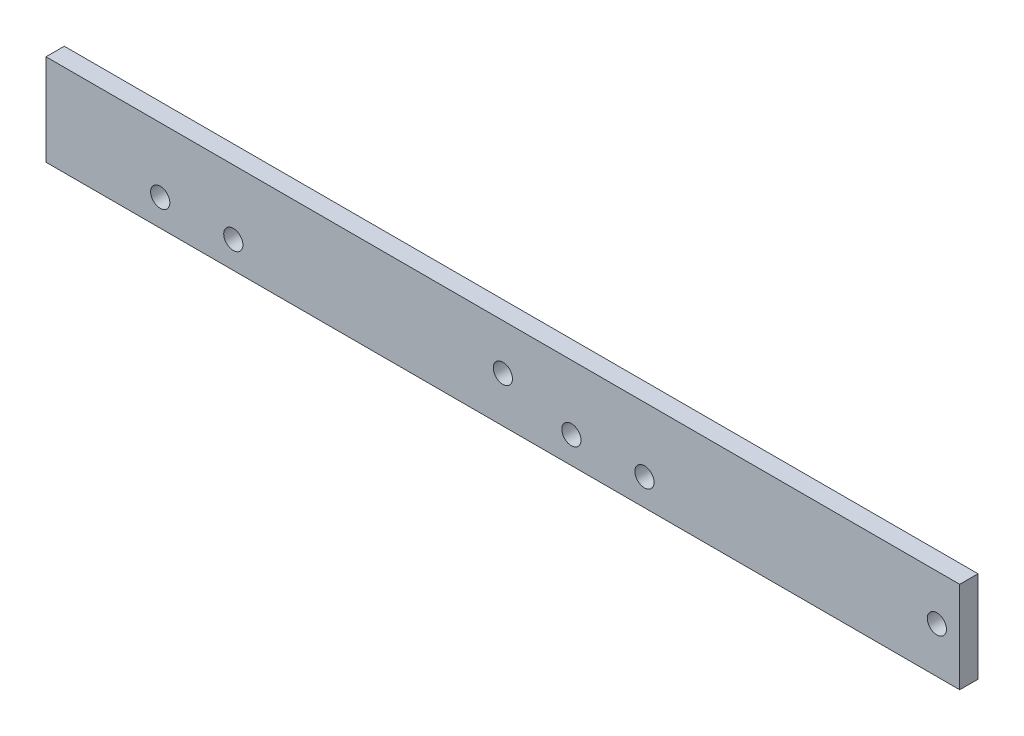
from build123d import *

# Parameters (mm, degrees)
SKETCH_1_W          = 200
SKETCH_1_H          = 20
SKETCH_1_R          = 2.1
EXTRUDE_1_DEPTH     = 4
SKETCH_2_R          = 2.1
CUT_EXTRUDE_1_DEPTH = 101.578327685


with BuildPart() as part:
    # Sketch 1 → Extrude 1 (new body)
    with BuildSketch(Plane.XY):
        Rectangle(SKETCH_1_W, SKETCH_1_H)
        with Locations((95, 0)):
            Circle(SKETCH_1_R, mode=Mode.SUBTRACT)
        Circle(SKETCH_1_R, mode=Mode.SUBTRACT)
    extrude(amount=EXTRUDE_1_DEPTH)

    # Sketch 2 → Cut-Extrude 1 (cut, through all)
    with BuildSketch(Plane.XY.offset(4)):
        with Locations((31, -4.129200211)):
            Circle(SKETCH_2_R)
        with Locations((15, -4.129200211)):
            Circle(SKETCH_2_R)
        with Locations((-59, -4.129200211)):
            Circle(SKETCH_2_R)
        with Locations((-75, -4.129200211)):
            Circle(SKETCH_2_R)
    extrude(amount=-CUT_EXTRUDE_1_DEPTH, mode=Mode.SUBTRACT)


solid = part.part
